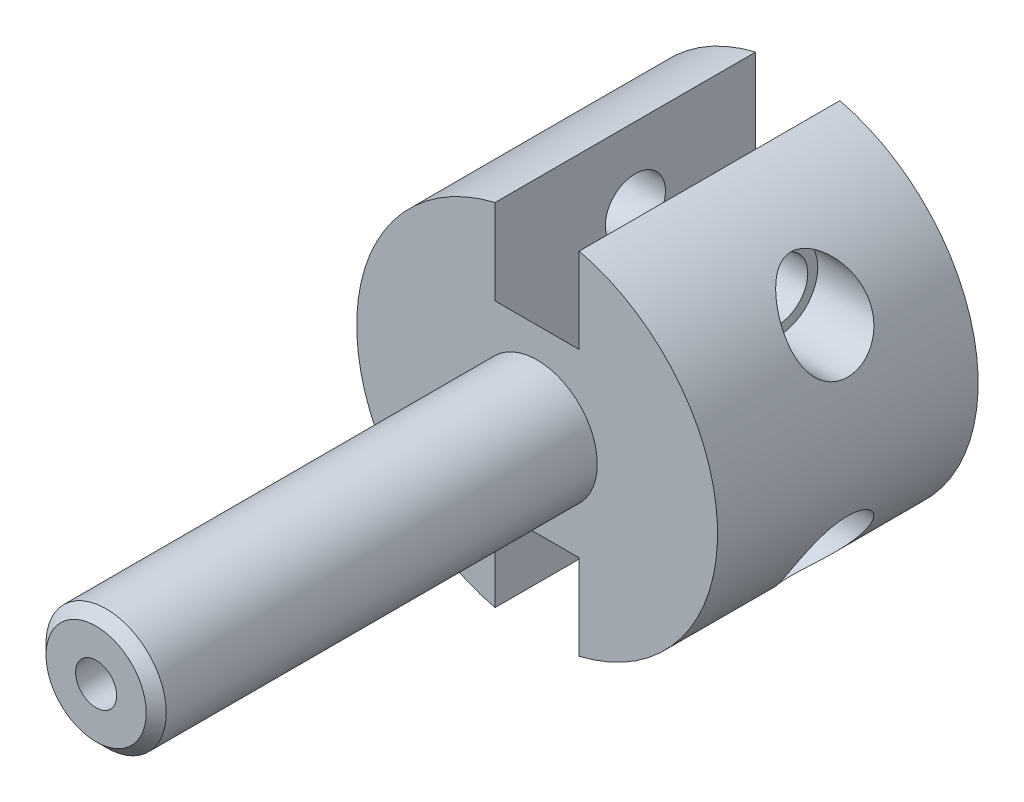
from build123d import *

# Parameters (mm, degrees)
ESQUISSE1_R                  = 9
EXTRUSION1_DEPTH             = 13
ESQUISSE2_R                  = 3
EXTRUSION2_DEPTH             = 22
CHANFREIN1_SIZE              = 0.5
ENL_V_MAT_EXTRU_1_DEPTH      = 2.1
ENL_V_MAT_EXTRU_2_DEPTH      = 38.183195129
ENL_V_MAT_EXTRU_2_DEPTH_BACK = 38.183195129
ESQUISSE4_R                  = 1.5
ESQUISSE5_R                  = 2
ENL_V_MAT_EXTRU_3_DEPTH      = 4.2
TROU_TARAUD_M2_5X0_451_D     = 2.05
TROU_TARAUD_M2_5X0_451_DEPTH = 7.25
TROU_TARAUD_M2_5X0_451_TIP   = 0.615882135
TROU_TARAUD_M3X0_52_D        = 2.4
TROU_TARAUD_M3X0_52_DEPTH    = 10.5
TROU_TARAUD_M3X0_52_TIP      = 0.721032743


with BuildPart() as part:
    # Esquisse1 → Extrusion1 (new body)
    with BuildSketch(Plane.XY):
        Circle(ESQUISSE1_R)
    extrude(amount=EXTRUSION1_DEPTH)

    # Esquisse2 → Extrusion2 (add)
    with BuildSketch(Plane.XY.offset(13)):
        Circle(ESQUISSE2_R)
    extrude(amount=EXTRUSION2_DEPTH)

    # Chanfrein1
    chanfrein1_edges = [part.edges().sort_by_distance(p)[0] for p in [
        (-3, 0, 35),
    ]]
    chamfer(chanfrein1_edges, length=CHANFREIN1_SIZE)

    # Esquisse3 → Enl_v. mat.-Extru.1 (cut, symmetric)
    with BuildSketch(Plane(origin=(0, 0, 0), x_dir=(0, 0, -1), z_dir=(1, 0, 0))):
        with BuildLine():
            Line((-13, 9), (-13, 4.5))
            ThreePointArc((-13, 4.5), (-11.5, 0), (-13, -4.5))
            Line((-13, -4.5), (-13, -9))
            Line((-13, -9), (1.270193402, -9))
            Line((1.270193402, -9), (1.270193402, 9))
            Line((1.270193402, 9), (-13, 9))
        make_face()
    extrude(amount=ENL_V_MAT_EXTRU_1_DEPTH, both=True, mode=Mode.SUBTRACT)

    # Esquisse4 → Enl_v. mat.-Extru.2 (cut, two sides: drawn at the far end of the back side and taken through both)
    with BuildSketch(Plane(origin=(0, 0, 0), x_dir=(0, 0, -1), z_dir=(1, 0, 0)).offset(-ENL_V_MAT_EXTRU_2_DEPTH_BACK)):
        with Locations((-6, 5)):
            Circle(ESQUISSE4_R)
        with Locations((-6, -5)):
            Circle(ESQUISSE4_R)
    extrude(amount=ENL_V_MAT_EXTRU_2_DEPTH + ENL_V_MAT_EXTRU_2_DEPTH_BACK, mode=Mode.SUBTRACT)

    # Esquisse5 → Enl_v. mat.-Extru.3 (cut)
    with BuildSketch(Plane(origin=(5, 0, 0), x_dir=(0, 0, -1), z_dir=(1, 0, 0))):
        with Locations(Location((-6, 5, 0), (0, 0, 180))):
            Circle(ESQUISSE5_R)
        with Locations(Location((-6, -5, 0), (0, 0, 180))):
            Circle(ESQUISSE5_R)
    extrude(amount=ENL_V_MAT_EXTRU_3_DEPTH, mode=Mode.SUBTRACT)

    # Trou taraud_ M2.5x0.451
    with Locations(Plane.XY.offset(35)):
        with Locations((0, 0)):
            Hole(TROU_TARAUD_M2_5X0_451_D / 2, depth=TROU_TARAUD_M2_5X0_451_DEPTH)
            with Locations((0, 0, -(TROU_TARAUD_M2_5X0_451_DEPTH + TROU_TARAUD_M2_5X0_451_TIP / 2))):  # 118° drill point
                Cone(0, TROU_TARAUD_M2_5X0_451_D / 2, TROU_TARAUD_M2_5X0_451_TIP, mode=Mode.SUBTRACT)

    # Trou taraud_ M3x0.52
    with Locations(Plane(origin=(0, 0, 0), x_dir=(-1, 0, 0), z_dir=(0, 0, -1))):
        with Locations((-5.5, 0), (5.5, 0)):
            Hole(TROU_TARAUD_M3X0_52_D / 2, depth=TROU_TARAUD_M3X0_52_DEPTH)
            with Locations((0, 0, -(TROU_TARAUD_M3X0_52_DEPTH + TROU_TARAUD_M3X0_52_TIP / 2))):  # 118° drill point
                Cone(0, TROU_TARAUD_M3X0_52_D / 2, TROU_TARAUD_M3X0_52_TIP, mode=Mode.SUBTRACT)


solid = part.part
